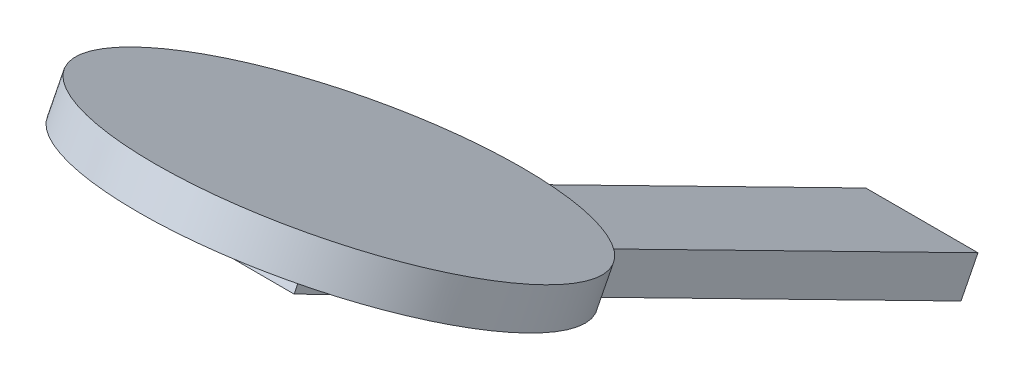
ISO-10303-21;
HEADER;
FILE_DESCRIPTION(('STEP AP214'),'2;1');
FILE_NAME('part.step','',(''),(''),'','','');
FILE_SCHEMA(('AUTOMOTIVE_DESIGN { 1 0 10303 214 1 1 1 1 }'));
ENDSEC;
DATA;
#1=APPLICATION_CONTEXT('core data for automotive mechanical design processes');
#2=APPLICATION_PROTOCOL_DEFINITION('international standard','automotive_design',2000,#1);
#3=PRODUCT_CONTEXT('',#1,'mechanical');
#4=PRODUCT('Part','Part','',(#3));
#5=PRODUCT_RELATED_PRODUCT_CATEGORY('part','',(#4));
#6=PRODUCT_DEFINITION_FORMATION('','',#4);
#7=PRODUCT_DEFINITION_CONTEXT('part definition',#1,'design');
#8=PRODUCT_DEFINITION('design','',#6,#7);
#9=PRODUCT_DEFINITION_SHAPE('','',#8);
#10=(LENGTH_UNIT() NAMED_UNIT(*) SI_UNIT(.MILLI.,.METRE.));
#11=(NAMED_UNIT(*) PLANE_ANGLE_UNIT() SI_UNIT($,.RADIAN.));
#12=(NAMED_UNIT(*) SI_UNIT($,.STERADIAN.) SOLID_ANGLE_UNIT());
#13=UNCERTAINTY_MEASURE_WITH_UNIT(LENGTH_MEASURE(1.E-05),#10,'distance_accuracy_value','');
#14=(GEOMETRIC_REPRESENTATION_CONTEXT(3) GLOBAL_UNCERTAINTY_ASSIGNED_CONTEXT((#13)) GLOBAL_UNIT_ASSIGNED_CONTEXT((#10,
#11,#12)) REPRESENTATION_CONTEXT('',''));
#15=CARTESIAN_POINT('',(0.,0.,0.));
#16=DIRECTION('',(0.,0.,1.));
#17=DIRECTION('',(1.,0.,0.));
#18=AXIS2_PLACEMENT_3D('',#15,#16,#17);
#19=CARTESIAN_POINT('',(0.,250.265398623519,-127.381854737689));
#20=DIRECTION('',(0.,-0.891200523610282,0.453609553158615));
#21=DIRECTION('',(0.,-0.453609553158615,-0.891200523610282));
#22=AXIS2_PLACEMENT_3D('',#19,#20,#21);
#23=PLANE('',#22);
#24=DIRECTION('',(-0.999992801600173,-0.00172113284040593,-0.0033814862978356));
#25=VECTOR('',#24,1.);
#26=CARTESIAN_POINT('',(15.,259.363472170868,-109.506993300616));
#27=LINE('',#26,#25);
#28=CARTESIAN_POINT('',(15.,259.363472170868,-109.506993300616));
#29=VERTEX_POINT('',#28);
#30=CARTESIAN_POINT('',(-15.,259.311837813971,-109.608438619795));
#31=VERTEX_POINT('',#30);
#32=EDGE_CURVE('E93',#29,#31,#27,.T.);
#33=ORIENTED_EDGE('',*,*,#32,.F.);
#34=DIRECTION('',(0.,-0.453609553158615,-0.891200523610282));
#35=VECTOR('',#34,1.);
#36=CARTESIAN_POINT('',(15.,250.265398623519,-127.381854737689));
#37=LINE('',#36,#35);
#38=CARTESIAN_POINT('',(15.,226.221380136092,-174.620811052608));
#39=VERTEX_POINT('',#38);
#40=EDGE_CURVE('E11',#29,#39,#37,.T.);
#41=ORIENTED_EDGE('',*,*,#40,.T.);
#42=CARTESIAN_POINT('',(0.,250.265398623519,-127.381854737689));
#43=DIRECTION('',(0.,-0.891200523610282,0.453609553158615));
#44=DIRECTION('',(0.,-0.453609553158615,-0.891200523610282));
#45=AXIS2_PLACEMENT_3D('',#42,#43,#44);
#46=CIRCLE('',#45,55.0875105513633);
#47=CARTESIAN_POINT('',(-15.,226.221380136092,-174.620811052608));
#48=VERTEX_POINT('',#47);
#49=EDGE_CURVE('E40',#39,#48,#46,.T.);
#50=ORIENTED_EDGE('',*,*,#49,.T.);
#51=DIRECTION('',(0.,-0.453609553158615,-0.891200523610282));
#52=VECTOR('',#51,1.);
#53=CARTESIAN_POINT('',(-15.,259.311837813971,-109.608438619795));
#54=LINE('',#53,#52);
#55=EDGE_CURVE('E99',#31,#48,#54,.T.);
#56=ORIENTED_EDGE('',*,*,#55,.F.);
#57=EDGE_LOOP('',(#33,#41,#50,#56));
#58=FACE_BOUND('',#57,.T.);
#59=ADVANCED_FACE('F32',(#58),#23,.T.);
#60=CARTESIAN_POINT('',(0.,250.265398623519,-127.381854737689));
#61=DIRECTION('',(0.,0.891200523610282,-0.453609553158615));
#62=DIRECTION('',(0.,0.453609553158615,0.891200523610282));
#63=AXIS2_PLACEMENT_3D('',#60,#61,#62);
#64=CYLINDRICAL_SURFACE('',#63,55.0875105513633);
#65=ORIENTED_EDGE('',*,*,#49,.F.);
#66=EDGE_CURVE('E55',#48,#39,#46,.T.);
#67=ORIENTED_EDGE('',*,*,#66,.F.);
#68=EDGE_LOOP('',(#65,#67));
#69=FACE_BOUND('',#68,.T.);
#70=CARTESIAN_POINT('',(0.,259.177403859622,-131.917950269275));
#71=DIRECTION('',(0.,-0.891200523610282,0.453609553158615));
#72=DIRECTION('',(0.,-0.453609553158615,-0.891200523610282));
#73=AXIS2_PLACEMENT_3D('',#70,#71,#72);
#74=CIRCLE('',#73,55.0875105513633);
#75=CARTESIAN_POINT('',(0.,234.189182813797,-181.011968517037));
#76=VERTEX_POINT('',#75);
#77=EDGE_CURVE('E97',#76,#76,#74,.T.);
#78=ORIENTED_EDGE('',*,*,#77,.T.);
#79=EDGE_LOOP('',(#78));
#80=FACE_BOUND('',#79,.T.);
#81=ADVANCED_FACE('F34',(#69,#80),#64,.T.);
#82=CARTESIAN_POINT('',(0.,259.177403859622,-131.917950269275));
#83=DIRECTION('',(0.,-0.891200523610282,0.453609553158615));
#84=DIRECTION('',(0.,-0.453609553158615,-0.891200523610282));
#85=AXIS2_PLACEMENT_3D('',#82,#83,#84);
#86=PLANE('',#85);
#87=ORIENTED_EDGE('',*,*,#77,.F.);
#88=EDGE_LOOP('',(#87));
#89=FACE_BOUND('',#88,.T.);
#90=ADVANCED_FACE('F124',(#89),#86,.F.);
#91=CARTESIAN_POINT('',(15.,168.589927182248,-287.848543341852));
#92=DIRECTION('',(0.,0.891200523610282,-0.453609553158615));
#93=DIRECTION('',(0.,0.453609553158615,0.891200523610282));
#94=AXIS2_PLACEMENT_3D('',#91,#92,#93);
#95=PLANE('',#94);
#96=ORIENTED_EDGE('',*,*,#66,.T.);
#97=DIRECTION('',(0.,0.453609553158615,0.891200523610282));
#98=VECTOR('',#97,1.);
#99=CARTESIAN_POINT('',(15.,259.363472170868,-109.506993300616));
#100=LINE('',#99,#98);
#101=CARTESIAN_POINT('',(15.,168.589927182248,-287.848543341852));
#102=VERTEX_POINT('',#101);
#103=EDGE_CURVE('E86',#102,#39,#100,.T.);
#104=ORIENTED_EDGE('',*,*,#103,.F.);
#105=DIRECTION('',(1.,0.,0.));
#106=VECTOR('',#105,1.);
#107=CARTESIAN_POINT('',(15.,168.589927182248,-287.848543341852));
#108=LINE('',#107,#106);
#109=CARTESIAN_POINT('',(-15.,168.589927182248,-287.848543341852));
#110=VERTEX_POINT('',#109);
#111=EDGE_CURVE('E105',#110,#102,#108,.T.);
#112=ORIENTED_EDGE('',*,*,#111,.F.);
#113=EDGE_CURVE('E100',#48,#110,#54,.T.);
#114=ORIENTED_EDGE('',*,*,#113,.F.);
#115=EDGE_LOOP('',(#96,#104,#112,#114));
#116=FACE_BOUND('',#115,.T.);
#117=ADVANCED_FACE('F128',(#116),#95,.T.);
#118=CARTESIAN_POINT('',(15.,250.451466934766,-104.97089776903));
#119=DIRECTION('',(-1.,0.,0.));
#120=DIRECTION('',(0.,0.,1.));
#121=AXIS2_PLACEMENT_3D('',#118,#119,#120);
#122=PLANE('',#121);
#123=ORIENTED_EDGE('',*,*,#103,.T.);
#124=ORIENTED_EDGE('',*,*,#40,.F.);
#125=DIRECTION('',(0.,0.891200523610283,-0.453609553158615));
#126=VECTOR('',#125,1.);
#127=CARTESIAN_POINT('',(15.,250.451466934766,-104.97089776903));
#128=LINE('',#127,#126);
#129=CARTESIAN_POINT('',(15.,250.451466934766,-104.97089776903));
#130=VERTEX_POINT('',#129);
#131=EDGE_CURVE('E84',#130,#29,#128,.T.);
#132=ORIENTED_EDGE('',*,*,#131,.F.);
#133=DIRECTION('',(0.,0.453609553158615,0.891200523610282));
#134=VECTOR('',#133,1.);
#135=CARTESIAN_POINT('',(15.,250.451466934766,-104.97089776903));
#136=LINE('',#135,#134);
#137=CARTESIAN_POINT('',(15.,159.677921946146,-283.312447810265));
#138=VERTEX_POINT('',#137);
#139=EDGE_CURVE('E107',#138,#130,#136,.T.);
#140=ORIENTED_EDGE('',*,*,#139,.F.);
#141=DIRECTION('',(0.,0.891200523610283,-0.453609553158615));
#142=VECTOR('',#141,1.);
#143=CARTESIAN_POINT('',(15.,159.677921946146,-283.312447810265));
#144=LINE('',#143,#142);
#145=EDGE_CURVE('E114',#138,#102,#144,.T.);
#146=ORIENTED_EDGE('',*,*,#145,.T.);
#147=EDGE_LOOP('',(#123,#124,#132,#140,#146));
#148=FACE_BOUND('',#147,.T.);
#149=ADVANCED_FACE('F82',(#148),#122,.F.);
#150=CARTESIAN_POINT('',(15.,250.451466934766,-104.97089776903));
#151=DIRECTION('',(0.00379430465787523,-0.453606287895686,-0.891194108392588));
#152=DIRECTION('',(0.,0.891200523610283,-0.453609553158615));
#153=AXIS2_PLACEMENT_3D('',#150,#151,#152);
#154=PLANE('',#153);
#155=ORIENTED_EDGE('',*,*,#32,.T.);
#156=DIRECTION('',(0.,0.891200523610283,-0.453609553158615));
#157=VECTOR('',#156,1.);
#158=CARTESIAN_POINT('',(-15.,250.399832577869,-105.072343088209));
#159=LINE('',#158,#157);
#160=CARTESIAN_POINT('',(-15.,250.399832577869,-105.072343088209));
#161=VERTEX_POINT('',#160);
#162=EDGE_CURVE('E47',#161,#31,#159,.T.);
#163=ORIENTED_EDGE('',*,*,#162,.F.);
#164=DIRECTION('',(-0.999992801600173,-0.00172113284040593,-0.0033814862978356));
#165=VECTOR('',#164,1.);
#166=CARTESIAN_POINT('',(15.,250.451466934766,-104.97089776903));
#167=LINE('',#166,#165);
#168=EDGE_CURVE('E95',#130,#161,#167,.T.);
#169=ORIENTED_EDGE('',*,*,#168,.F.);
#170=ORIENTED_EDGE('',*,*,#131,.T.);
#171=EDGE_LOOP('',(#155,#163,#169,#170));
#172=FACE_BOUND('',#171,.T.);
#173=ADVANCED_FACE('F92',(#172),#154,.F.);
#174=CARTESIAN_POINT('',(-15.,250.399832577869,-105.072343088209));
#175=DIRECTION('',(1.,0.,0.));
#176=DIRECTION('',(0.,0.,-1.));
#177=AXIS2_PLACEMENT_3D('',#174,#175,#176);
#178=PLANE('',#177);
#179=ORIENTED_EDGE('',*,*,#55,.T.);
#180=ORIENTED_EDGE('',*,*,#113,.T.);
#181=DIRECTION('',(0.,0.891200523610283,-0.453609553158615));
#182=VECTOR('',#181,1.);
#183=CARTESIAN_POINT('',(-15.,159.677921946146,-283.312447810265));
#184=LINE('',#183,#182);
#185=CARTESIAN_POINT('',(-15.,159.677921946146,-283.312447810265));
#186=VERTEX_POINT('',#185);
#187=EDGE_CURVE('E116',#186,#110,#184,.T.);
#188=ORIENTED_EDGE('',*,*,#187,.F.);
#189=DIRECTION('',(0.,-0.453609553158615,-0.891200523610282));
#190=VECTOR('',#189,1.);
#191=CARTESIAN_POINT('',(-15.,250.399832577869,-105.072343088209));
#192=LINE('',#191,#190);
#193=EDGE_CURVE('E110',#161,#186,#192,.T.);
#194=ORIENTED_EDGE('',*,*,#193,.F.);
#195=ORIENTED_EDGE('',*,*,#162,.T.);
#196=EDGE_LOOP('',(#179,#180,#188,#194,#195));
#197=FACE_BOUND('',#196,.T.);
#198=ADVANCED_FACE('F165',(#197),#178,.F.);
#199=CARTESIAN_POINT('',(15.,159.677921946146,-283.312447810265));
#200=DIRECTION('',(0.,0.453609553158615,0.891200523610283));
#201=DIRECTION('',(0.,-0.891200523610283,0.453609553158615));
#202=AXIS2_PLACEMENT_3D('',#199,#200,#201);
#203=PLANE('',#202);
#204=ORIENTED_EDGE('',*,*,#111,.T.);
#205=ORIENTED_EDGE('',*,*,#145,.F.);
#206=DIRECTION('',(1.,0.,0.));
#207=VECTOR('',#206,1.);
#208=CARTESIAN_POINT('',(15.,159.677921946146,-283.312447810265));
#209=LINE('',#208,#207);
#210=EDGE_CURVE('E112',#186,#138,#209,.T.);
#211=ORIENTED_EDGE('',*,*,#210,.F.);
#212=ORIENTED_EDGE('',*,*,#187,.T.);
#213=EDGE_LOOP('',(#204,#205,#211,#212));
#214=FACE_BOUND('',#213,.T.);
#215=ADVANCED_FACE('F174',(#214),#203,.F.);
#216=CARTESIAN_POINT('',(15.,159.677921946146,-283.312447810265));
#217=DIRECTION('',(0.,0.891200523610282,-0.453609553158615));
#218=DIRECTION('',(0.,0.453609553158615,0.891200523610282));
#219=AXIS2_PLACEMENT_3D('',#216,#217,#218);
#220=PLANE('',#219);
#221=ORIENTED_EDGE('',*,*,#139,.T.);
#222=ORIENTED_EDGE('',*,*,#168,.T.);
#223=ORIENTED_EDGE('',*,*,#193,.T.);
#224=ORIENTED_EDGE('',*,*,#210,.T.);
#225=EDGE_LOOP('',(#221,#222,#223,#224));
#226=FACE_BOUND('',#225,.T.);
#227=ADVANCED_FACE('F183',(#226),#220,.F.);
#228=CLOSED_SHELL('',(#59,#81,#90,#117,#149,#173,#198,#215,#227));
#229=MANIFOLD_SOLID_BREP('B2',#228);
#230=ADVANCED_BREP_SHAPE_REPRESENTATION('',(#18,#229),#14);
#231=SHAPE_DEFINITION_REPRESENTATION(#9,#230);
ENDSEC;
END-ISO-10303-21;
